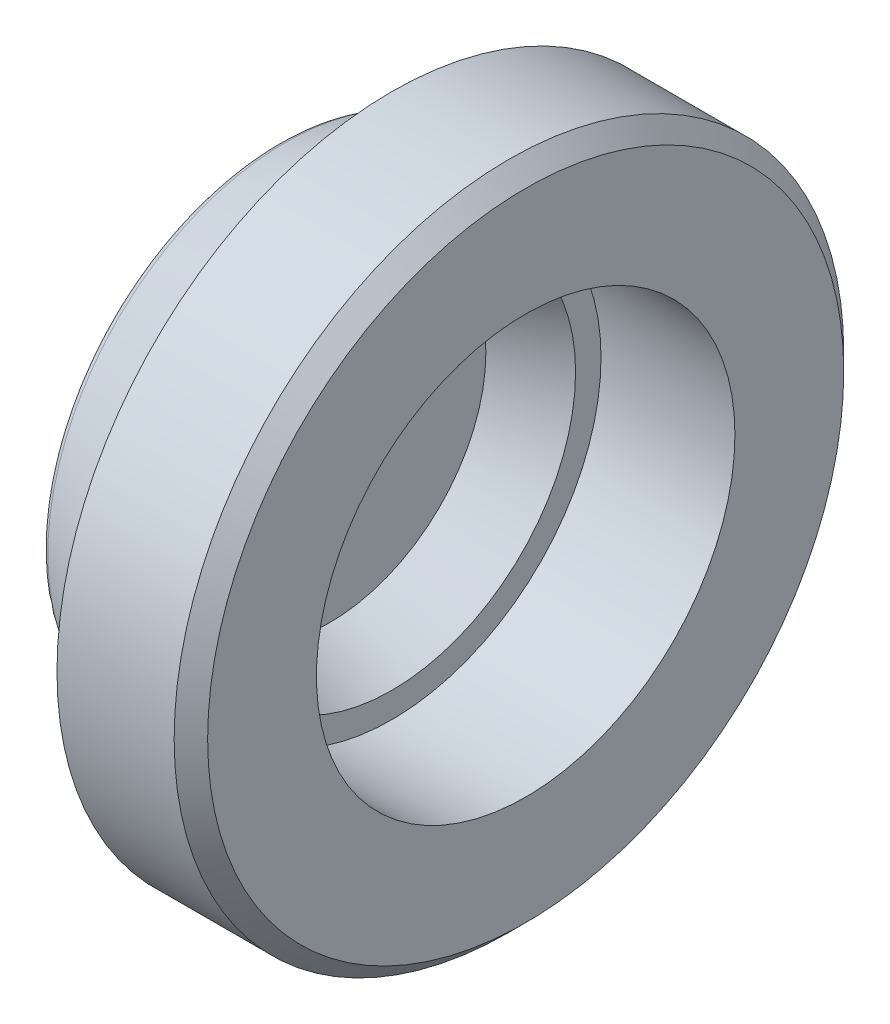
ISO-10303-21;
HEADER;
FILE_DESCRIPTION(('STEP AP214'),'2;1');
FILE_NAME('part.step','',(''),(''),'','','');
FILE_SCHEMA(('AUTOMOTIVE_DESIGN { 1 0 10303 214 1 1 1 1 }'));
ENDSEC;
DATA;
#1=APPLICATION_CONTEXT('core data for automotive mechanical design processes');
#2=APPLICATION_PROTOCOL_DEFINITION('international standard','automotive_design',2000,#1);
#3=PRODUCT_CONTEXT('',#1,'mechanical');
#4=PRODUCT('Part','Part','',(#3));
#5=PRODUCT_RELATED_PRODUCT_CATEGORY('part','',(#4));
#6=PRODUCT_DEFINITION_FORMATION('','',#4);
#7=PRODUCT_DEFINITION_CONTEXT('part definition',#1,'design');
#8=PRODUCT_DEFINITION('design','',#6,#7);
#9=PRODUCT_DEFINITION_SHAPE('','',#8);
#10=(LENGTH_UNIT() NAMED_UNIT(*) SI_UNIT(.MILLI.,.METRE.));
#11=(NAMED_UNIT(*) PLANE_ANGLE_UNIT() SI_UNIT($,.RADIAN.));
#12=(NAMED_UNIT(*) SI_UNIT($,.STERADIAN.) SOLID_ANGLE_UNIT());
#13=UNCERTAINTY_MEASURE_WITH_UNIT(LENGTH_MEASURE(1.E-05),#10,'distance_accuracy_value','');
#14=(GEOMETRIC_REPRESENTATION_CONTEXT(3) GLOBAL_UNCERTAINTY_ASSIGNED_CONTEXT((#13)) GLOBAL_UNIT_ASSIGNED_CONTEXT((#10,
#11,#12)) REPRESENTATION_CONTEXT('',''));
#15=CARTESIAN_POINT('',(0.,0.,0.));
#16=DIRECTION('',(0.,0.,1.));
#17=DIRECTION('',(1.,0.,0.));
#18=AXIS2_PLACEMENT_3D('',#15,#16,#17);
#19=CARTESIAN_POINT('',(-6.939242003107,0.,0.));
#20=DIRECTION('',(1.,0.,0.));
#21=DIRECTION('',(0.,0.,-1.));
#22=AXIS2_PLACEMENT_3D('',#19,#20,#21);
#23=PLANE('',#22);
#24=CARTESIAN_POINT('',(-6.939242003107,0.,0.));
#25=DIRECTION('',(1.,0.,0.));
#26=DIRECTION('',(0.,-1.,0.));
#27=AXIS2_PLACEMENT_3D('',#24,#25,#26);
#28=CIRCLE('',#27,13.28782625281);
#29=CARTESIAN_POINT('',(-6.939242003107,-13.28782625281,0.));
#30=VERTEX_POINT('',#29);
#31=CARTESIAN_POINT('',(-6.939242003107,13.28782625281,0.));
#32=VERTEX_POINT('',#31);
#33=EDGE_CURVE('E44',#30,#32,#28,.T.);
#34=ORIENTED_EDGE('',*,*,#33,.F.);
#35=CARTESIAN_POINT('',(-6.939242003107,0.,0.));
#36=DIRECTION('',(1.,0.,0.));
#37=DIRECTION('',(0.,1.,0.));
#38=AXIS2_PLACEMENT_3D('',#35,#36,#37);
#39=CIRCLE('',#38,13.28782625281);
#40=EDGE_CURVE('E48',#32,#30,#39,.T.);
#41=ORIENTED_EDGE('',*,*,#40,.F.);
#42=EDGE_LOOP('',(#34,#41));
#43=FACE_BOUND('',#42,.T.);
#44=ADVANCED_FACE('F16',(#43),#23,.F.);
#45=CARTESIAN_POINT('',(-5.939242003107,0.,0.));
#46=DIRECTION('',(1.,0.,0.));
#47=DIRECTION('',(0.,-0.999965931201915,-0.00825447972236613));
#48=AXIS2_PLACEMENT_3D('',#45,#46,#47);
#49=TOROIDAL_SURFACE('',#48,13.28782625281,1.);
#50=CARTESIAN_POINT('',(-6.34597702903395,0.,0.));
#51=DIRECTION('',(1.,0.,0.));
#52=DIRECTION('',(0.,-1.,0.));
#53=AXIS2_PLACEMENT_3D('',#50,#51,#52);
#54=CIRCLE('',#53,14.2013724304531);
#55=CARTESIAN_POINT('',(-6.34597702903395,-14.2013724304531,0.));
#56=VERTEX_POINT('',#55);
#57=EDGE_CURVE('E54',#56,#56,#54,.T.);
#58=ORIENTED_EDGE('',*,*,#57,.F.);
#59=EDGE_LOOP('',(#58));
#60=FACE_BOUND('',#59,.T.);
#61=ORIENTED_EDGE('',*,*,#40,.T.);
#62=ORIENTED_EDGE('',*,*,#33,.T.);
#63=EDGE_LOOP('',(#61,#62));
#64=FACE_BOUND('',#63,.T.);
#65=ADVANCED_FACE('F53',(#60,#64),#49,.T.);
#66=CARTESIAN_POINT('',(-0.59326497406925,0.,0.));
#67=DIRECTION('',(1.,0.,0.));
#68=DIRECTION('',(0.,0.,-1.));
#69=AXIS2_PLACEMENT_3D('',#66,#67,#68);
#70=CONICAL_SURFACE('',#69,16.7626326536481,0.418877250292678);
#71=ORIENTED_EDGE('',*,*,#57,.T.);
#72=EDGE_LOOP('',(#71));
#73=FACE_BOUND('',#72,.T.);
#74=CARTESIAN_POINT('',(-0.593264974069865,0.,0.));
#75=DIRECTION('',(1.,0.,0.));
#76=DIRECTION('',(0.,-0.999966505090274,-0.00818466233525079));
#77=AXIS2_PLACEMENT_3D('',#74,#75,#76);
#78=CIRCLE('',#77,16.7626326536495);
#79=CARTESIAN_POINT('',(-0.593264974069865,-16.762071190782,-0.13719648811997));
#80=VERTEX_POINT('',#79);
#81=EDGE_CURVE('E78',#80,#80,#78,.F.);
#82=ORIENTED_EDGE('',*,*,#81,.T.);
#83=EDGE_LOOP('',(#82));
#84=FACE_BOUND('',#83,.T.);
#85=ADVANCED_FACE('F70',(#73,#84),#70,.T.);
#86=CARTESIAN_POINT('',(-1.,0.,0.));
#87=DIRECTION('',(1.,0.,0.));
#88=DIRECTION('',(0.,-0.999966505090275,-0.00818466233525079));
#89=AXIS2_PLACEMENT_3D('',#86,#87,#88);
#90=TOROIDAL_SURFACE('',#89,17.67617883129,1.);
#91=ORIENTED_EDGE('',*,*,#81,.F.);
#92=EDGE_LOOP('',(#91));
#93=FACE_BOUND('',#92,.T.);
#94=CARTESIAN_POINT('',(0.,0.,0.));
#95=DIRECTION('',(-1.,0.,0.));
#96=DIRECTION('',(0.,1.,0.));
#97=AXIS2_PLACEMENT_3D('',#94,#95,#96);
#98=CIRCLE('',#97,17.67617883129);
#99=CARTESIAN_POINT('',(0.,17.67617883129,0.));
#100=VERTEX_POINT('',#99);
#101=CARTESIAN_POINT('',(0.,-17.67617883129,0.));
#102=VERTEX_POINT('',#101);
#103=EDGE_CURVE('E35',#100,#102,#98,.T.);
#104=ORIENTED_EDGE('',*,*,#103,.T.);
#105=CARTESIAN_POINT('',(0.,0.,0.));
#106=DIRECTION('',(-1.,0.,0.));
#107=DIRECTION('',(0.,-1.,0.));
#108=AXIS2_PLACEMENT_3D('',#105,#106,#107);
#109=CIRCLE('',#108,17.67617883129);
#110=EDGE_CURVE('E144',#102,#100,#109,.T.);
#111=ORIENTED_EDGE('',*,*,#110,.T.);
#112=EDGE_LOOP('',(#104,#111));
#113=FACE_BOUND('',#112,.T.);
#114=ADVANCED_FACE('F85',(#93,#113),#90,.F.);
#115=CARTESIAN_POINT('',(-3.707322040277,0.,0.));
#116=DIRECTION('',(1.,0.,0.));
#117=DIRECTION('',(0.,0.,-1.));
#118=AXIS2_PLACEMENT_3D('',#115,#116,#117);
#119=PLANE('',#118);
#120=CARTESIAN_POINT('',(-3.70732204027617,0.,0.));
#121=DIRECTION('',(1.,0.,0.));
#122=DIRECTION('',(0.,0.,-1.));
#123=AXIS2_PLACEMENT_3D('',#120,#121,#122);
#124=CIRCLE('',#123,9.33019023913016);
#125=CARTESIAN_POINT('',(-3.70732204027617,0.,-9.33019023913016));
#126=VERTEX_POINT('',#125);
#127=EDGE_CURVE('E140',#126,#126,#124,.T.);
#128=ORIENTED_EDGE('',*,*,#127,.T.);
#129=EDGE_LOOP('',(#128));
#130=FACE_BOUND('',#129,.T.);
#131=ADVANCED_FACE('F94',(#130),#119,.T.);
#132=CARTESIAN_POINT('',(0.,0.,0.));
#133=DIRECTION('',(1.,0.,0.));
#134=DIRECTION('',(0.,0.,-1.));
#135=AXIS2_PLACEMENT_3D('',#132,#133,#134);
#136=PLANE('',#135);
#137=ORIENTED_EDGE('',*,*,#103,.F.);
#138=ORIENTED_EDGE('',*,*,#110,.F.);
#139=EDGE_LOOP('',(#137,#138));
#140=FACE_BOUND('',#139,.T.);
#141=CARTESIAN_POINT('',(0.,0.,0.));
#142=DIRECTION('',(1.,0.,0.));
#143=DIRECTION('',(0.,0.,-1.));
#144=AXIS2_PLACEMENT_3D('',#141,#142,#143);
#145=CIRCLE('',#144,20.);
#146=CARTESIAN_POINT('',(0.,0.,-20.));
#147=VERTEX_POINT('',#146);
#148=EDGE_CURVE('E135',#147,#147,#145,.T.);
#149=ORIENTED_EDGE('',*,*,#148,.F.);
#150=EDGE_LOOP('',(#149));
#151=FACE_BOUND('',#150,.T.);
#152=ADVANCED_FACE('F104',(#140,#151),#136,.F.);
#153=CARTESIAN_POINT('',(0.,0.,0.));
#154=DIRECTION('',(1.,0.,0.));
#155=DIRECTION('',(0.,0.,-1.));
#156=AXIS2_PLACEMENT_3D('',#153,#154,#155);
#157=CONICAL_SURFACE('',#156,10.9807884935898,0.418877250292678);
#158=ORIENTED_EDGE('',*,*,#127,.F.);
#159=EDGE_LOOP('',(#158));
#160=FACE_BOUND('',#159,.T.);
#161=CARTESIAN_POINT('',(0.,0.,0.));
#162=DIRECTION('',(1.,0.,0.));
#163=DIRECTION('',(0.,0.,-1.));
#164=AXIS2_PLACEMENT_3D('',#161,#162,#163);
#165=CIRCLE('',#164,10.9807884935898);
#166=CARTESIAN_POINT('',(0.,0.,-10.9807884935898));
#167=VERTEX_POINT('',#166);
#168=EDGE_CURVE('E129',#167,#167,#165,.F.);
#169=ORIENTED_EDGE('',*,*,#168,.F.);
#170=EDGE_LOOP('',(#169));
#171=FACE_BOUND('',#170,.T.);
#172=ADVANCED_FACE('F113',(#160,#171),#157,.F.);
#173=CARTESIAN_POINT('',(0.,0.,0.));
#174=DIRECTION('',(1.,0.,0.));
#175=DIRECTION('',(0.,0.,-1.));
#176=AXIS2_PLACEMENT_3D('',#173,#174,#175);
#177=CYLINDRICAL_SURFACE('',#176,20.);
#178=ORIENTED_EDGE('',*,*,#148,.T.);
#179=EDGE_LOOP('',(#178));
#180=FACE_BOUND('',#179,.T.);
#181=CARTESIAN_POINT('',(7.00000000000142,0.,0.));
#182=DIRECTION('',(-1.,0.,0.));
#183=DIRECTION('',(0.,0.,-1.));
#184=AXIS2_PLACEMENT_3D('',#181,#182,#183);
#185=CIRCLE('',#184,20.0000000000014);
#186=CARTESIAN_POINT('',(7.00000000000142,0.,-20.0000000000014));
#187=VERTEX_POINT('',#186);
#188=EDGE_CURVE('E126',#187,#187,#185,.F.);
#189=ORIENTED_EDGE('',*,*,#188,.F.);
#190=EDGE_LOOP('',(#189));
#191=FACE_BOUND('',#190,.T.);
#192=ADVANCED_FACE('F158',(#180,#191),#177,.T.);
#193=CARTESIAN_POINT('',(0.,0.,0.));
#194=DIRECTION('',(1.,0.,0.));
#195=DIRECTION('',(0.,0.,-1.));
#196=AXIS2_PLACEMENT_3D('',#193,#194,#195);
#197=PLANE('',#196);
#198=ORIENTED_EDGE('',*,*,#168,.T.);
#199=EDGE_LOOP('',(#198));
#200=FACE_BOUND('',#199,.T.);
#201=CARTESIAN_POINT('',(0.,0.,0.));
#202=DIRECTION('',(1.,0.,0.));
#203=DIRECTION('',(0.,0.,-1.));
#204=AXIS2_PLACEMENT_3D('',#201,#202,#203);
#205=CIRCLE('',#204,12.5);
#206=CARTESIAN_POINT('',(0.,0.,-12.5));
#207=VERTEX_POINT('',#206);
#208=EDGE_CURVE('E128',#207,#207,#205,.T.);
#209=ORIENTED_EDGE('',*,*,#208,.T.);
#210=EDGE_LOOP('',(#209));
#211=FACE_BOUND('',#210,.T.);
#212=ADVANCED_FACE('F161',(#200,#211),#197,.T.);
#213=CARTESIAN_POINT('',(7.00000000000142,0.,0.));
#214=DIRECTION('',(-1.,0.,0.));
#215=DIRECTION('',(0.,0.,1.));
#216=AXIS2_PLACEMENT_3D('',#213,#214,#215);
#217=CONICAL_SURFACE('',#216,20.0000000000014,0.785398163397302);
#218=ORIENTED_EDGE('',*,*,#188,.T.);
#219=EDGE_LOOP('',(#218));
#220=FACE_BOUND('',#219,.T.);
#221=CARTESIAN_POINT('',(8.00000000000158,0.,0.));
#222=DIRECTION('',(-1.,0.,0.));
#223=DIRECTION('',(0.,0.,1.));
#224=AXIS2_PLACEMENT_3D('',#221,#222,#223);
#225=CIRCLE('',#224,19.0000000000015);
#226=CARTESIAN_POINT('',(8.00000000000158,0.,19.0000000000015));
#227=VERTEX_POINT('',#226);
#228=EDGE_CURVE('E27',#227,#227,#225,.F.);
#229=ORIENTED_EDGE('',*,*,#228,.F.);
#230=EDGE_LOOP('',(#229));
#231=FACE_BOUND('',#230,.T.);
#232=ADVANCED_FACE('F168',(#220,#231),#217,.T.);
#233=CARTESIAN_POINT('',(0.,0.,0.));
#234=DIRECTION('',(1.,0.,0.));
#235=DIRECTION('',(0.,0.,-1.));
#236=AXIS2_PLACEMENT_3D('',#233,#234,#235);
#237=CYLINDRICAL_SURFACE('',#236,12.5);
#238=CARTESIAN_POINT('',(8.,0.,0.));
#239=DIRECTION('',(1.,0.,0.));
#240=DIRECTION('',(0.,0.,-1.));
#241=AXIS2_PLACEMENT_3D('',#238,#239,#240);
#242=CIRCLE('',#241,12.5);
#243=CARTESIAN_POINT('',(8.,0.,-12.5));
#244=VERTEX_POINT('',#243);
#245=EDGE_CURVE('E11',#244,#244,#242,.F.);
#246=ORIENTED_EDGE('',*,*,#245,.F.);
#247=EDGE_LOOP('',(#246));
#248=FACE_BOUND('',#247,.T.);
#249=ORIENTED_EDGE('',*,*,#208,.F.);
#250=EDGE_LOOP('',(#249));
#251=FACE_BOUND('',#250,.T.);
#252=ADVANCED_FACE('F173',(#248,#251),#237,.F.);
#253=CARTESIAN_POINT('',(8.,0.,0.));
#254=DIRECTION('',(1.,0.,0.));
#255=DIRECTION('',(0.,0.,-1.));
#256=AXIS2_PLACEMENT_3D('',#253,#254,#255);
#257=PLANE('',#256);
#258=ORIENTED_EDGE('',*,*,#245,.T.);
#259=EDGE_LOOP('',(#258));
#260=FACE_BOUND('',#259,.T.);
#261=ORIENTED_EDGE('',*,*,#228,.T.);
#262=EDGE_LOOP('',(#261));
#263=FACE_BOUND('',#262,.T.);
#264=ADVANCED_FACE('F171',(#260,#263),#257,.T.);
#265=CLOSED_SHELL('',(#44,#65,#85,#114,#131,#152,#172,#192,#212,#232,#252,#264));
#266=MANIFOLD_SOLID_BREP('B1',#265);
#267=ADVANCED_BREP_SHAPE_REPRESENTATION('',(#18,#266),#14);
#268=SHAPE_DEFINITION_REPRESENTATION(#9,#267);
ENDSEC;
END-ISO-10303-21;
